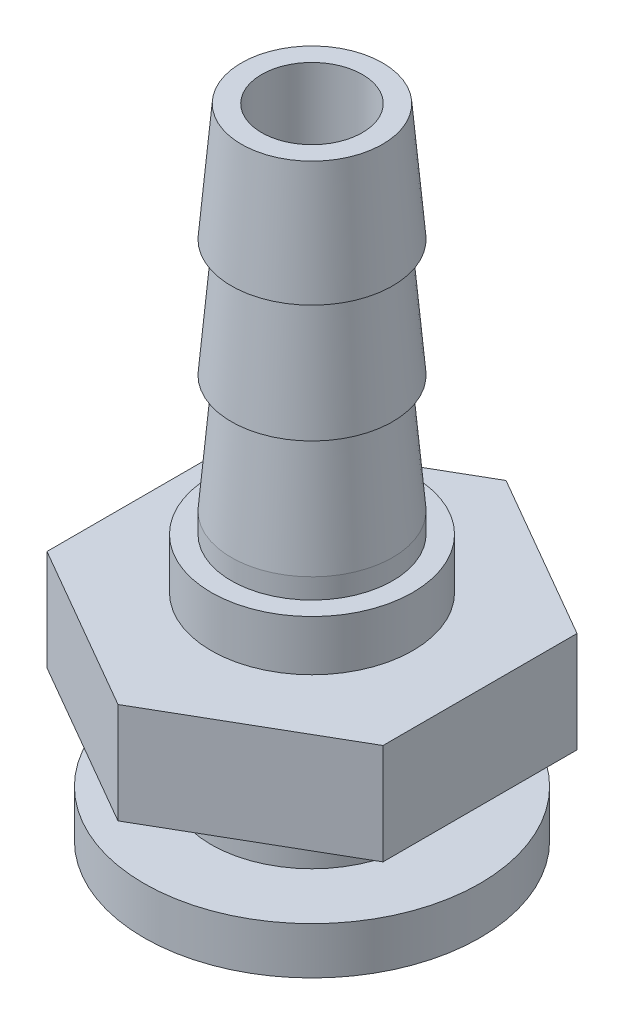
from build123d import *

# Parameters (mm, degrees)
ESQUISSE2_R        = 1.5
BOSS_EXTRU_1_DEPTH = 3


with BuildPart() as part:
    # Esquisse1 → R_volution1 (revolve)
    with BuildSketch(Plane(origin=(0, 0, 0), x_dir=(0, 0, -1), z_dir=(1, 0, 0)), mode=Mode.PRIVATE) as r_volution1_sk:
        Polygon((-1.5, 0), (-5, 0), (-5, 1.4), (-3, 1.4), (-3, 7.9), (-2.4, 7.9), (-2.4, 8.5), (-2.1, 12), (-2.4, 12), (-2.1, 15.5), (-2.4, 15.5), (-2.1, 19), (-1.5, 19), align=None)
    revolve(r_volution1_sk.sketch.rotate(Axis((0, 0, 0), (0, 1, 0)), 180), axis=Axis((0, 0, 0), (0, 1, 0)))

    # Esquisse2 → Boss.-Extru.1 (add)
    with BuildSketch(Plane(origin=(0, 3.4, 0), x_dir=(1, 0, 0), z_dir=(0, 1, 0))):
        Polygon((5, -2.886751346), (5, 2.886751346), (0, 5.773502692), (-5, 2.886751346), (-5, -2.886751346), (0, -5.773502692), align=None)
        with Locations(Location((0, 0, 0), (0, 0, 90))):
            Circle(ESQUISSE2_R, mode=Mode.SUBTRACT)
    extrude(amount=BOSS_EXTRU_1_DEPTH)


solid = part.part
